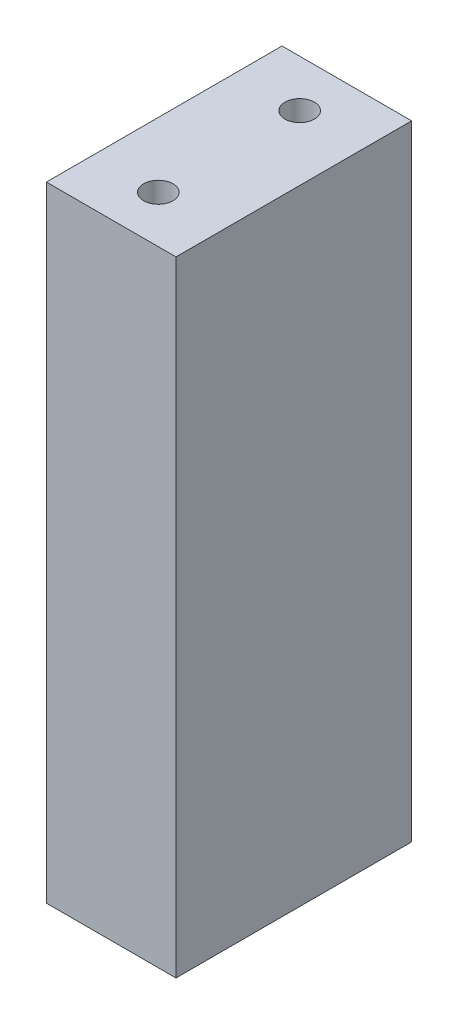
ISO-10303-21;
HEADER;
FILE_DESCRIPTION(('STEP AP214'),'2;1');
FILE_NAME('part.step','',(''),(''),'','','');
FILE_SCHEMA(('AUTOMOTIVE_DESIGN { 1 0 10303 214 1 1 1 1 }'));
ENDSEC;
DATA;
#1=APPLICATION_CONTEXT('core data for automotive mechanical design processes');
#2=APPLICATION_PROTOCOL_DEFINITION('international standard','automotive_design',2000,#1);
#3=PRODUCT_CONTEXT('',#1,'mechanical');
#4=PRODUCT('Part','Part','',(#3));
#5=PRODUCT_RELATED_PRODUCT_CATEGORY('part','',(#4));
#6=PRODUCT_DEFINITION_FORMATION('','',#4);
#7=PRODUCT_DEFINITION_CONTEXT('part definition',#1,'design');
#8=PRODUCT_DEFINITION('design','',#6,#7);
#9=PRODUCT_DEFINITION_SHAPE('','',#8);
#10=(LENGTH_UNIT() NAMED_UNIT(*) SI_UNIT(.MILLI.,.METRE.));
#11=(NAMED_UNIT(*) PLANE_ANGLE_UNIT() SI_UNIT($,.RADIAN.));
#12=(NAMED_UNIT(*) SI_UNIT($,.STERADIAN.) SOLID_ANGLE_UNIT());
#13=UNCERTAINTY_MEASURE_WITH_UNIT(LENGTH_MEASURE(1.E-05),#10,'distance_accuracy_value','');
#14=(GEOMETRIC_REPRESENTATION_CONTEXT(3) GLOBAL_UNCERTAINTY_ASSIGNED_CONTEXT((#13)) GLOBAL_UNIT_ASSIGNED_CONTEXT((#10,
#11,#12)) REPRESENTATION_CONTEXT('',''));
#15=CARTESIAN_POINT('',(0.,0.,0.));
#16=DIRECTION('',(0.,0.,1.));
#17=DIRECTION('',(1.,0.,0.));
#18=AXIS2_PLACEMENT_3D('',#15,#16,#17);
#19=CARTESIAN_POINT('',(0.,88.9999999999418,-12.));
#20=DIRECTION('',(0.,1.,0.));
#21=DIRECTION('',(0.,0.,1.));
#22=AXIS2_PLACEMENT_3D('',#19,#20,#21);
#23=CONICAL_SURFACE('',#22,2.49999999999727,1.0297442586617);
#24=CARTESIAN_POINT('',(0.,87.4978484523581,-12.));
#25=VERTEX_POINT('',#24);
#26=VERTEX_LOOP('',#25);
#27=FACE_BOUND('',#26,.T.);
#28=CARTESIAN_POINT('',(0.,89.,-12.));
#29=DIRECTION('',(0.,1.,0.));
#30=DIRECTION('',(0.,0.,1.));
#31=AXIS2_PLACEMENT_3D('',#28,#29,#30);
#32=CIRCLE('',#31,2.49999999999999);
#33=CARTESIAN_POINT('',(0.,89.,-9.50000000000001));
#34=VERTEX_POINT('',#33);
#35=EDGE_CURVE('E71',#34,#34,#32,.T.);
#36=ORIENTED_EDGE('',*,*,#35,.T.);
#37=EDGE_LOOP('',(#36));
#38=FACE_BOUND('',#37,.T.);
#39=ADVANCED_FACE('F17',(#27,#38),#23,.F.);
#40=CARTESIAN_POINT('',(0.,88.9999999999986,12.));
#41=DIRECTION('',(0.,1.,0.));
#42=DIRECTION('',(0.,0.,1.));
#43=AXIS2_PLACEMENT_3D('',#40,#41,#42);
#44=CONICAL_SURFACE('',#43,2.50000000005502,1.0297442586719);
#45=CARTESIAN_POINT('',(0.,87.4978484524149,12.));
#46=VERTEX_POINT('',#45);
#47=VERTEX_LOOP('',#46);
#48=FACE_BOUND('',#47,.T.);
#49=CARTESIAN_POINT('',(0.,89.,12.));
#50=DIRECTION('',(0.,1.,0.));
#51=DIRECTION('',(0.,0.,1.));
#52=AXIS2_PLACEMENT_3D('',#49,#50,#51);
#53=CIRCLE('',#52,2.49999999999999);
#54=CARTESIAN_POINT('',(0.,89.,14.5));
#55=VERTEX_POINT('',#54);
#56=EDGE_CURVE('E73',#55,#55,#53,.T.);
#57=ORIENTED_EDGE('',*,*,#56,.T.);
#58=EDGE_LOOP('',(#57));
#59=FACE_BOUND('',#58,.T.);
#60=ADVANCED_FACE('F68',(#48,#59),#44,.F.);
#61=CARTESIAN_POINT('',(0.,17.0000000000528,-12.));
#62=DIRECTION('',(0.,-1.,0.));
#63=DIRECTION('',(0.,0.,-1.));
#64=AXIS2_PLACEMENT_3D('',#61,#62,#63);
#65=CONICAL_SURFACE('',#64,2.49999999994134,1.02974425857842);
#66=CARTESIAN_POINT('',(0.,18.5021515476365,-12.));
#67=VERTEX_POINT('',#66);
#68=VERTEX_LOOP('',#67);
#69=FACE_BOUND('',#68,.T.);
#70=CARTESIAN_POINT('',(0.,17.,-12.));
#71=DIRECTION('',(0.,-1.,0.));
#72=DIRECTION('',(0.,0.,-1.));
#73=AXIS2_PLACEMENT_3D('',#70,#71,#72);
#74=CIRCLE('',#73,2.49999999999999);
#75=CARTESIAN_POINT('',(0.,17.,-14.5));
#76=VERTEX_POINT('',#75);
#77=EDGE_CURVE('E76',#76,#76,#74,.T.);
#78=ORIENTED_EDGE('',*,*,#77,.T.);
#79=EDGE_LOOP('',(#78));
#80=FACE_BOUND('',#79,.T.);
#81=ADVANCED_FACE('F110',(#69,#80),#65,.F.);
#82=CARTESIAN_POINT('',(0.,17.0000000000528,12.));
#83=DIRECTION('',(0.,-1.,0.));
#84=DIRECTION('',(0.,0.,-1.));
#85=AXIS2_PLACEMENT_3D('',#82,#83,#84);
#86=CONICAL_SURFACE('',#85,2.49999999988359,1.02974425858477);
#87=CARTESIAN_POINT('',(0.,18.5021515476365,12.));
#88=VERTEX_POINT('',#87);
#89=VERTEX_LOOP('',#88);
#90=FACE_BOUND('',#89,.T.);
#91=CARTESIAN_POINT('',(0.,17.,12.));
#92=DIRECTION('',(0.,-1.,0.));
#93=DIRECTION('',(0.,0.,-1.));
#94=AXIS2_PLACEMENT_3D('',#91,#92,#93);
#95=CIRCLE('',#94,2.49999999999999);
#96=CARTESIAN_POINT('',(0.,17.,9.50000000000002));
#97=VERTEX_POINT('',#96);
#98=EDGE_CURVE('E99',#97,#97,#95,.T.);
#99=ORIENTED_EDGE('',*,*,#98,.T.);
#100=EDGE_LOOP('',(#99));
#101=FACE_BOUND('',#100,.T.);
#102=ADVANCED_FACE('F220',(#90,#101),#86,.F.);
#103=CARTESIAN_POINT('',(0.,106.,-12.));
#104=DIRECTION('',(0.,1.,0.));
#105=DIRECTION('',(0.,0.,1.));
#106=AXIS2_PLACEMENT_3D('',#103,#104,#105);
#107=CYLINDRICAL_SURFACE('',#106,2.49999999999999);
#108=ORIENTED_EDGE('',*,*,#35,.F.);
#109=EDGE_LOOP('',(#108));
#110=FACE_BOUND('',#109,.T.);
#111=CARTESIAN_POINT('',(0.,106.,-12.));
#112=DIRECTION('',(0.,1.,0.));
#113=DIRECTION('',(0.,0.,1.));
#114=AXIS2_PLACEMENT_3D('',#111,#112,#113);
#115=CIRCLE('',#114,2.49999999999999);
#116=CARTESIAN_POINT('',(0.,106.,-9.50000000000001));
#117=VERTEX_POINT('',#116);
#118=EDGE_CURVE('E20',#117,#117,#115,.T.);
#119=ORIENTED_EDGE('',*,*,#118,.T.);
#120=EDGE_LOOP('',(#119));
#121=FACE_BOUND('',#120,.T.);
#122=ADVANCED_FACE('F126',(#110,#121),#107,.F.);
#123=CARTESIAN_POINT('',(0.,106.,12.));
#124=DIRECTION('',(0.,1.,0.));
#125=DIRECTION('',(0.,0.,1.));
#126=AXIS2_PLACEMENT_3D('',#123,#124,#125);
#127=CYLINDRICAL_SURFACE('',#126,2.49999999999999);
#128=ORIENTED_EDGE('',*,*,#56,.F.);
#129=EDGE_LOOP('',(#128));
#130=FACE_BOUND('',#129,.T.);
#131=CARTESIAN_POINT('',(0.,106.,12.));
#132=DIRECTION('',(0.,1.,0.));
#133=DIRECTION('',(0.,0.,1.));
#134=AXIS2_PLACEMENT_3D('',#131,#132,#133);
#135=CIRCLE('',#134,2.49999999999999);
#136=CARTESIAN_POINT('',(0.,106.,14.5));
#137=VERTEX_POINT('',#136);
#138=EDGE_CURVE('E87',#137,#137,#135,.T.);
#139=ORIENTED_EDGE('',*,*,#138,.T.);
#140=EDGE_LOOP('',(#139));
#141=FACE_BOUND('',#140,.T.);
#142=ADVANCED_FACE('F115',(#130,#141),#127,.F.);
#143=CARTESIAN_POINT('',(0.,0.,-12.));
#144=DIRECTION('',(0.,-1.,0.));
#145=DIRECTION('',(0.,0.,-1.));
#146=AXIS2_PLACEMENT_3D('',#143,#144,#145);
#147=CYLINDRICAL_SURFACE('',#146,2.49999999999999);
#148=CARTESIAN_POINT('',(0.,0.,-12.));
#149=DIRECTION('',(0.,-1.,0.));
#150=DIRECTION('',(0.,0.,-1.));
#151=AXIS2_PLACEMENT_3D('',#148,#149,#150);
#152=CIRCLE('',#151,2.49999999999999);
#153=CARTESIAN_POINT('',(0.,0.,-14.5));
#154=VERTEX_POINT('',#153);
#155=EDGE_CURVE('E84',#154,#154,#152,.F.);
#156=ORIENTED_EDGE('',*,*,#155,.F.);
#157=EDGE_LOOP('',(#156));
#158=FACE_BOUND('',#157,.T.);
#159=ORIENTED_EDGE('',*,*,#77,.F.);
#160=EDGE_LOOP('',(#159));
#161=FACE_BOUND('',#160,.T.);
#162=ADVANCED_FACE('F112',(#158,#161),#147,.F.);
#163=CARTESIAN_POINT('',(0.,0.,12.));
#164=DIRECTION('',(0.,-1.,0.));
#165=DIRECTION('',(0.,0.,-1.));
#166=AXIS2_PLACEMENT_3D('',#163,#164,#165);
#167=CYLINDRICAL_SURFACE('',#166,2.49999999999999);
#168=CARTESIAN_POINT('',(0.,0.,12.));
#169=DIRECTION('',(0.,-1.,0.));
#170=DIRECTION('',(0.,0.,-1.));
#171=AXIS2_PLACEMENT_3D('',#168,#169,#170);
#172=CIRCLE('',#171,2.49999999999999);
#173=CARTESIAN_POINT('',(0.,0.,9.50000000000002));
#174=VERTEX_POINT('',#173);
#175=EDGE_CURVE('E80',#174,#174,#172,.F.);
#176=ORIENTED_EDGE('',*,*,#175,.F.);
#177=EDGE_LOOP('',(#176));
#178=FACE_BOUND('',#177,.T.);
#179=ORIENTED_EDGE('',*,*,#98,.F.);
#180=EDGE_LOOP('',(#179));
#181=FACE_BOUND('',#180,.T.);
#182=ADVANCED_FACE('F114',(#178,#181),#167,.F.);
#183=CARTESIAN_POINT('',(-11.,106.,20.));
#184=DIRECTION('',(1.,0.,0.));
#185=DIRECTION('',(0.,0.,-1.));
#186=AXIS2_PLACEMENT_3D('',#183,#184,#185);
#187=PLANE('',#186);
#188=DIRECTION('',(0.,1.,0.));
#189=VECTOR('',#188,1.);
#190=CARTESIAN_POINT('',(-11.,106.,20.));
#191=LINE('',#190,#189);
#192=CARTESIAN_POINT('',(-11.,0.,20.));
#193=VERTEX_POINT('',#192);
#194=CARTESIAN_POINT('',(-11.,106.,20.));
#195=VERTEX_POINT('',#194);
#196=EDGE_CURVE('E96',#193,#195,#191,.T.);
#197=ORIENTED_EDGE('',*,*,#196,.T.);
#198=DIRECTION('',(0.,0.,-1.));
#199=VECTOR('',#198,1.);
#200=CARTESIAN_POINT('',(-11.,106.,0.));
#201=LINE('',#200,#199);
#202=CARTESIAN_POINT('',(-11.,106.,-20.));
#203=VERTEX_POINT('',#202);
#204=EDGE_CURVE('E93',#195,#203,#201,.T.);
#205=ORIENTED_EDGE('',*,*,#204,.T.);
#206=DIRECTION('',(0.,1.,0.));
#207=VECTOR('',#206,1.);
#208=CARTESIAN_POINT('',(-11.,106.,-20.));
#209=LINE('',#208,#207);
#210=CARTESIAN_POINT('',(-11.,0.,-20.));
#211=VERTEX_POINT('',#210);
#212=EDGE_CURVE('E86',#203,#211,#209,.F.);
#213=ORIENTED_EDGE('',*,*,#212,.T.);
#214=DIRECTION('',(0.,0.,-1.));
#215=VECTOR('',#214,1.);
#216=CARTESIAN_POINT('',(-11.,0.,0.));
#217=LINE('',#216,#215);
#218=EDGE_CURVE('E300',#193,#211,#217,.T.);
#219=ORIENTED_EDGE('',*,*,#218,.F.);
#220=EDGE_LOOP('',(#197,#205,#213,#219));
#221=FACE_BOUND('',#220,.T.);
#222=ADVANCED_FACE('F123',(#221),#187,.F.);
#223=CARTESIAN_POINT('',(-11.,106.,20.));
#224=DIRECTION('',(0.,0.,-1.));
#225=DIRECTION('',(-1.,0.,0.));
#226=AXIS2_PLACEMENT_3D('',#223,#224,#225);
#227=PLANE('',#226);
#228=DIRECTION('',(0.,1.,0.));
#229=VECTOR('',#228,1.);
#230=CARTESIAN_POINT('',(11.,106.,20.));
#231=LINE('',#230,#229);
#232=CARTESIAN_POINT('',(11.,0.,20.));
#233=VERTEX_POINT('',#232);
#234=CARTESIAN_POINT('',(11.,106.,20.));
#235=VERTEX_POINT('',#234);
#236=EDGE_CURVE('E293',#233,#235,#231,.T.);
#237=ORIENTED_EDGE('',*,*,#236,.T.);
#238=DIRECTION('',(1.,0.,0.));
#239=VECTOR('',#238,1.);
#240=CARTESIAN_POINT('',(0.,106.,20.));
#241=LINE('',#240,#239);
#242=EDGE_CURVE('E89',#235,#195,#241,.F.);
#243=ORIENTED_EDGE('',*,*,#242,.T.);
#244=ORIENTED_EDGE('',*,*,#196,.F.);
#245=DIRECTION('',(1.,0.,0.));
#246=VECTOR('',#245,1.);
#247=CARTESIAN_POINT('',(0.,0.,20.));
#248=LINE('',#247,#246);
#249=EDGE_CURVE('E83',#233,#193,#248,.F.);
#250=ORIENTED_EDGE('',*,*,#249,.F.);
#251=EDGE_LOOP('',(#237,#243,#244,#250));
#252=FACE_BOUND('',#251,.T.);
#253=ADVANCED_FACE('F148',(#252),#227,.F.);
#254=CARTESIAN_POINT('',(0.,106.,0.));
#255=DIRECTION('',(0.,-1.,0.));
#256=DIRECTION('',(0.,0.,-1.));
#257=AXIS2_PLACEMENT_3D('',#254,#255,#256);
#258=PLANE('',#257);
#259=DIRECTION('',(1.,0.,0.));
#260=VECTOR('',#259,1.);
#261=CARTESIAN_POINT('',(-11.,106.,-20.));
#262=LINE('',#261,#260);
#263=CARTESIAN_POINT('',(11.,106.,-20.));
#264=VERTEX_POINT('',#263);
#265=EDGE_CURVE('E308',#264,#203,#262,.F.);
#266=ORIENTED_EDGE('',*,*,#265,.T.);
#267=ORIENTED_EDGE('',*,*,#204,.F.);
#268=ORIENTED_EDGE('',*,*,#242,.F.);
#269=DIRECTION('',(0.,0.,1.));
#270=VECTOR('',#269,1.);
#271=CARTESIAN_POINT('',(11.,106.,20.));
#272=LINE('',#271,#270);
#273=EDGE_CURVE('E296',#235,#264,#272,.F.);
#274=ORIENTED_EDGE('',*,*,#273,.T.);
#275=EDGE_LOOP('',(#266,#267,#268,#274));
#276=FACE_BOUND('',#275,.T.);
#277=ORIENTED_EDGE('',*,*,#138,.F.);
#278=EDGE_LOOP('',(#277));
#279=FACE_BOUND('',#278,.T.);
#280=ORIENTED_EDGE('',*,*,#118,.F.);
#281=EDGE_LOOP('',(#280));
#282=FACE_BOUND('',#281,.T.);
#283=ADVANCED_FACE('F144',(#276,#279,#282),#258,.F.);
#284=CARTESIAN_POINT('',(-11.,106.,-20.));
#285=DIRECTION('',(0.,0.,1.));
#286=DIRECTION('',(1.,0.,0.));
#287=AXIS2_PLACEMENT_3D('',#284,#285,#286);
#288=PLANE('',#287);
#289=ORIENTED_EDGE('',*,*,#212,.F.);
#290=ORIENTED_EDGE('',*,*,#265,.F.);
#291=DIRECTION('',(0.,1.,0.));
#292=VECTOR('',#291,1.);
#293=CARTESIAN_POINT('',(11.,106.,-20.));
#294=LINE('',#293,#292);
#295=CARTESIAN_POINT('',(11.,0.,-20.));
#296=VERTEX_POINT('',#295);
#297=EDGE_CURVE('E26',#264,#296,#294,.F.);
#298=ORIENTED_EDGE('',*,*,#297,.T.);
#299=DIRECTION('',(1.,0.,0.));
#300=VECTOR('',#299,1.);
#301=CARTESIAN_POINT('',(0.,0.,-20.));
#302=LINE('',#301,#300);
#303=EDGE_CURVE('E34',#211,#296,#302,.T.);
#304=ORIENTED_EDGE('',*,*,#303,.F.);
#305=EDGE_LOOP('',(#289,#290,#298,#304));
#306=FACE_BOUND('',#305,.T.);
#307=ADVANCED_FACE('F138',(#306),#288,.F.);
#308=CARTESIAN_POINT('',(0.,0.,0.));
#309=DIRECTION('',(0.,-1.,0.));
#310=DIRECTION('',(0.,0.,-1.));
#311=AXIS2_PLACEMENT_3D('',#308,#309,#310);
#312=PLANE('',#311);
#313=ORIENTED_EDGE('',*,*,#218,.T.);
#314=ORIENTED_EDGE('',*,*,#303,.T.);
#315=DIRECTION('',(0.,0.,1.));
#316=VECTOR('',#315,1.);
#317=CARTESIAN_POINT('',(11.,0.,20.));
#318=LINE('',#317,#316);
#319=EDGE_CURVE('E11',#296,#233,#318,.T.);
#320=ORIENTED_EDGE('',*,*,#319,.T.);
#321=ORIENTED_EDGE('',*,*,#249,.T.);
#322=EDGE_LOOP('',(#313,#314,#320,#321));
#323=FACE_BOUND('',#322,.T.);
#324=ORIENTED_EDGE('',*,*,#175,.T.);
#325=EDGE_LOOP('',(#324));
#326=FACE_BOUND('',#325,.T.);
#327=ORIENTED_EDGE('',*,*,#155,.T.);
#328=EDGE_LOOP('',(#327));
#329=FACE_BOUND('',#328,.T.);
#330=ADVANCED_FACE('F132',(#323,#326,#329),#312,.T.);
#331=CARTESIAN_POINT('',(11.,106.,20.));
#332=DIRECTION('',(-1.,0.,0.));
#333=DIRECTION('',(0.,0.,1.));
#334=AXIS2_PLACEMENT_3D('',#331,#332,#333);
#335=PLANE('',#334);
#336=ORIENTED_EDGE('',*,*,#297,.F.);
#337=ORIENTED_EDGE('',*,*,#273,.F.);
#338=ORIENTED_EDGE('',*,*,#236,.F.);
#339=ORIENTED_EDGE('',*,*,#319,.F.);
#340=EDGE_LOOP('',(#336,#337,#338,#339));
#341=FACE_BOUND('',#340,.T.);
#342=ADVANCED_FACE('F130',(#341),#335,.F.);
#343=CLOSED_SHELL('',(#39,#60,#81,#102,#122,#142,#162,#182,#222,#253,#283,#307,#330,#342));
#344=MANIFOLD_SOLID_BREP('B1',#343);
#345=ADVANCED_BREP_SHAPE_REPRESENTATION('',(#18,#344),#14);
#346=SHAPE_DEFINITION_REPRESENTATION(#9,#345);
ENDSEC;
END-ISO-10303-21;
